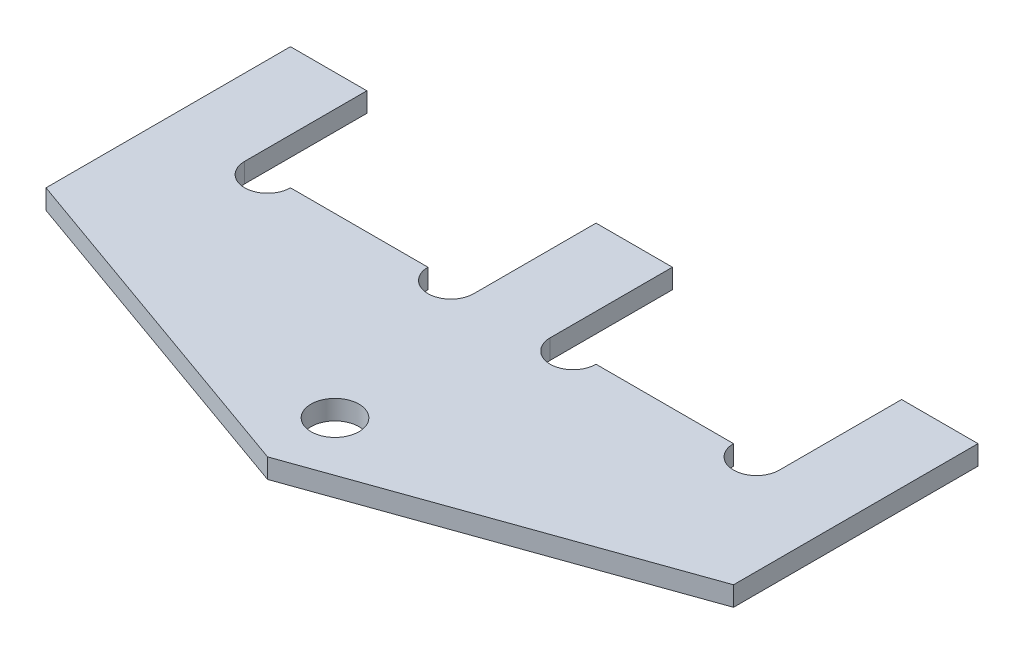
ISO-10303-21;
HEADER;
FILE_DESCRIPTION(('STEP AP214'),'2;1');
FILE_NAME('part.step','',(''),(''),'','','');
FILE_SCHEMA(('AUTOMOTIVE_DESIGN { 1 0 10303 214 1 1 1 1 }'));
ENDSEC;
DATA;
#1=APPLICATION_CONTEXT('core data for automotive mechanical design processes');
#2=APPLICATION_PROTOCOL_DEFINITION('international standard','automotive_design',2000,#1);
#3=PRODUCT_CONTEXT('',#1,'mechanical');
#4=PRODUCT('Part','Part','',(#3));
#5=PRODUCT_RELATED_PRODUCT_CATEGORY('part','',(#4));
#6=PRODUCT_DEFINITION_FORMATION('','',#4);
#7=PRODUCT_DEFINITION_CONTEXT('part definition',#1,'design');
#8=PRODUCT_DEFINITION('design','',#6,#7);
#9=PRODUCT_DEFINITION_SHAPE('','',#8);
#10=(LENGTH_UNIT() NAMED_UNIT(*) SI_UNIT(.MILLI.,.METRE.));
#11=(NAMED_UNIT(*) PLANE_ANGLE_UNIT() SI_UNIT($,.RADIAN.));
#12=(NAMED_UNIT(*) SI_UNIT($,.STERADIAN.) SOLID_ANGLE_UNIT());
#13=UNCERTAINTY_MEASURE_WITH_UNIT(LENGTH_MEASURE(1.E-05),#10,'distance_accuracy_value','');
#14=(GEOMETRIC_REPRESENTATION_CONTEXT(3) GLOBAL_UNCERTAINTY_ASSIGNED_CONTEXT((#13)) GLOBAL_UNIT_ASSIGNED_CONTEXT((#10,
#11,#12)) REPRESENTATION_CONTEXT('',''));
#15=CARTESIAN_POINT('',(0.,0.,0.));
#16=DIRECTION('',(0.,0.,1.));
#17=DIRECTION('',(1.,0.,0.));
#18=AXIS2_PLACEMENT_3D('',#15,#16,#17);
#19=CARTESIAN_POINT('',(0.,-2.032,7.0104));
#20=DIRECTION('',(-0.335009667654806,0.,0.942214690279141));
#21=DIRECTION('',(0.942214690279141,0.,0.335009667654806));
#22=AXIS2_PLACEMENT_3D('',#19,#20,#21);
#23=PLANE('',#22);
#24=DIRECTION('',(0.942214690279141,0.,0.335009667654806));
#25=VECTOR('',#24,1.);
#26=CARTESIAN_POINT('',(0.,0.,7.0104));
#27=LINE('',#26,#25);
#28=CARTESIAN_POINT('',(-35.71875,0.,-5.6896));
#29=VERTEX_POINT('',#28);
#30=CARTESIAN_POINT('',(0.,0.,7.0104));
#31=VERTEX_POINT('',#30);
#32=EDGE_CURVE('E188',#29,#31,#27,.T.);
#33=ORIENTED_EDGE('',*,*,#32,.F.);
#34=DIRECTION('',(0.,1.,0.));
#35=VECTOR('',#34,1.);
#36=CARTESIAN_POINT('',(-35.71875,-2.032,-5.6896));
#37=LINE('',#36,#35);
#38=CARTESIAN_POINT('',(-35.71875,-2.032,-5.6896));
#39=VERTEX_POINT('',#38);
#40=EDGE_CURVE('E11',#39,#29,#37,.T.);
#41=ORIENTED_EDGE('',*,*,#40,.F.);
#42=DIRECTION('',(0.942214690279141,0.,0.335009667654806));
#43=VECTOR('',#42,1.);
#44=CARTESIAN_POINT('',(0.,-2.032,7.0104));
#45=LINE('',#44,#43);
#46=CARTESIAN_POINT('',(0.,-2.032,7.0104));
#47=VERTEX_POINT('',#46);
#48=EDGE_CURVE('E236',#39,#47,#45,.T.);
#49=ORIENTED_EDGE('',*,*,#48,.T.);
#50=DIRECTION('',(0.,1.,0.));
#51=VECTOR('',#50,1.);
#52=CARTESIAN_POINT('',(0.,-2.032,7.0104));
#53=LINE('',#52,#51);
#54=EDGE_CURVE('E40',#47,#31,#53,.T.);
#55=ORIENTED_EDGE('',*,*,#54,.T.);
#56=EDGE_LOOP('',(#33,#41,#49,#55));
#57=FACE_BOUND('',#56,.T.);
#58=ADVANCED_FACE('F37',(#57),#23,.T.);
#59=CARTESIAN_POINT('',(-35.71875,-2.032,-5.6896));
#60=DIRECTION('',(-1.,0.,0.));
#61=DIRECTION('',(0.,0.,1.));
#62=AXIS2_PLACEMENT_3D('',#59,#60,#61);
#63=PLANE('',#62);
#64=DIRECTION('',(0.,0.,1.));
#65=VECTOR('',#64,1.);
#66=CARTESIAN_POINT('',(-35.71875,0.,-5.6896));
#67=LINE('',#66,#65);
#68=CARTESIAN_POINT('',(-35.71875,0.,-31.0896));
#69=VERTEX_POINT('',#68);
#70=EDGE_CURVE('E234',#69,#29,#67,.T.);
#71=ORIENTED_EDGE('',*,*,#70,.F.);
#72=DIRECTION('',(0.,1.,0.));
#73=VECTOR('',#72,1.);
#74=CARTESIAN_POINT('',(-35.71875,-2.032,-31.0896));
#75=LINE('',#74,#73);
#76=CARTESIAN_POINT('',(-35.71875,-2.032,-31.0896));
#77=VERTEX_POINT('',#76);
#78=EDGE_CURVE('E46',#77,#69,#75,.T.);
#79=ORIENTED_EDGE('',*,*,#78,.F.);
#80=DIRECTION('',(0.,0.,1.));
#81=VECTOR('',#80,1.);
#82=CARTESIAN_POINT('',(-35.71875,-2.032,-5.6896));
#83=LINE('',#82,#81);
#84=EDGE_CURVE('E178',#77,#39,#83,.T.);
#85=ORIENTED_EDGE('',*,*,#84,.T.);
#86=ORIENTED_EDGE('',*,*,#40,.T.);
#87=EDGE_LOOP('',(#71,#79,#85,#86));
#88=FACE_BOUND('',#87,.T.);
#89=ADVANCED_FACE('F266',(#88),#63,.T.);
#90=CARTESIAN_POINT('',(-35.71875,-2.032,-31.0896));
#91=DIRECTION('',(0.,0.,-1.));
#92=DIRECTION('',(-1.,0.,0.));
#93=AXIS2_PLACEMENT_3D('',#90,#91,#92);
#94=PLANE('',#93);
#95=DIRECTION('',(-1.,0.,0.));
#96=VECTOR('',#95,1.);
#97=CARTESIAN_POINT('',(-35.71875,0.,-31.0896));
#98=LINE('',#97,#96);
#99=CARTESIAN_POINT('',(-27.78125,0.,-31.0896));
#100=VERTEX_POINT('',#99);
#101=EDGE_CURVE('E165',#100,#69,#98,.T.);
#102=ORIENTED_EDGE('',*,*,#101,.F.);
#103=DIRECTION('',(0.,1.,0.));
#104=VECTOR('',#103,1.);
#105=CARTESIAN_POINT('',(-27.78125,-2.032,-31.0896));
#106=LINE('',#105,#104);
#107=CARTESIAN_POINT('',(-27.78125,-2.032,-31.0896));
#108=VERTEX_POINT('',#107);
#109=EDGE_CURVE('E160',#108,#100,#106,.T.);
#110=ORIENTED_EDGE('',*,*,#109,.F.);
#111=DIRECTION('',(-1.,0.,0.));
#112=VECTOR('',#111,1.);
#113=CARTESIAN_POINT('',(-35.71875,-2.032,-31.0896));
#114=LINE('',#113,#112);
#115=EDGE_CURVE('E163',#108,#77,#114,.T.);
#116=ORIENTED_EDGE('',*,*,#115,.T.);
#117=ORIENTED_EDGE('',*,*,#78,.T.);
#118=EDGE_LOOP('',(#102,#110,#116,#117));
#119=FACE_BOUND('',#118,.T.);
#120=ADVANCED_FACE('F162',(#119),#94,.T.);
#121=CARTESIAN_POINT('',(-27.78125,-2.032,-31.0896));
#122=DIRECTION('',(1.,0.,0.));
#123=DIRECTION('',(0.,0.,-1.));
#124=AXIS2_PLACEMENT_3D('',#121,#122,#123);
#125=PLANE('',#124);
#126=DIRECTION('',(0.,0.,-1.));
#127=VECTOR('',#126,1.);
#128=CARTESIAN_POINT('',(-27.78125,0.,-31.0896));
#129=LINE('',#128,#127);
#130=CARTESIAN_POINT('',(-27.78125,0.,-18.3896));
#131=VERTEX_POINT('',#130);
#132=EDGE_CURVE('E231',#131,#100,#129,.T.);
#133=ORIENTED_EDGE('',*,*,#132,.F.);
#134=DIRECTION('',(0.,1.,0.));
#135=VECTOR('',#134,1.);
#136=CARTESIAN_POINT('',(-27.78125,-2.032,-18.3896));
#137=LINE('',#136,#135);
#138=CARTESIAN_POINT('',(-27.78125,-2.032,-18.3896));
#139=VERTEX_POINT('',#138);
#140=EDGE_CURVE('E170',#139,#131,#137,.T.);
#141=ORIENTED_EDGE('',*,*,#140,.F.);
#142=DIRECTION('',(0.,0.,-1.));
#143=VECTOR('',#142,1.);
#144=CARTESIAN_POINT('',(-27.78125,-2.032,-31.0896));
#145=LINE('',#144,#143);
#146=EDGE_CURVE('E176',#139,#108,#145,.T.);
#147=ORIENTED_EDGE('',*,*,#146,.T.);
#148=ORIENTED_EDGE('',*,*,#109,.T.);
#149=EDGE_LOOP('',(#133,#141,#147,#148));
#150=FACE_BOUND('',#149,.T.);
#151=ADVANCED_FACE('F180',(#150),#125,.T.);
#152=CARTESIAN_POINT('',(-25.4,-2.032,-18.3896));
#153=DIRECTION('',(0.,1.,0.));
#154=DIRECTION('',(0.,0.,1.));
#155=AXIS2_PLACEMENT_3D('',#152,#153,#154);
#156=CYLINDRICAL_SURFACE('',#155,2.38125);
#157=CARTESIAN_POINT('',(-25.4,0.,-18.3896));
#158=DIRECTION('',(0.,-1.,0.));
#159=DIRECTION('',(0.,0.,1.));
#160=AXIS2_PLACEMENT_3D('',#157,#158,#159);
#161=CIRCLE('',#160,2.38125);
#162=CARTESIAN_POINT('',(-23.01875,0.,-18.3896));
#163=VERTEX_POINT('',#162);
#164=EDGE_CURVE('E228',#163,#131,#161,.T.);
#165=ORIENTED_EDGE('',*,*,#164,.F.);
#166=DIRECTION('',(0.,1.,0.));
#167=VECTOR('',#166,1.);
#168=CARTESIAN_POINT('',(-23.01875,-2.032,-18.3896));
#169=LINE('',#168,#167);
#170=CARTESIAN_POINT('',(-23.01875,-2.032,-18.3896));
#171=VERTEX_POINT('',#170);
#172=EDGE_CURVE('E240',#171,#163,#169,.T.);
#173=ORIENTED_EDGE('',*,*,#172,.F.);
#174=CARTESIAN_POINT('',(-25.4,-2.032,-18.3896));
#175=DIRECTION('',(0.,-1.,0.));
#176=DIRECTION('',(0.,0.,1.));
#177=AXIS2_PLACEMENT_3D('',#174,#175,#176);
#178=CIRCLE('',#177,2.38125);
#179=EDGE_CURVE('E181',#171,#139,#178,.T.);
#180=ORIENTED_EDGE('',*,*,#179,.T.);
#181=ORIENTED_EDGE('',*,*,#140,.T.);
#182=EDGE_LOOP('',(#165,#173,#180,#181));
#183=FACE_BOUND('',#182,.T.);
#184=ADVANCED_FACE('F279',(#183),#156,.F.);
#185=CARTESIAN_POINT('',(-23.01875,-2.032,-18.3896));
#186=DIRECTION('',(0.,0.,-1.));
#187=DIRECTION('',(-1.,0.,0.));
#188=AXIS2_PLACEMENT_3D('',#185,#186,#187);
#189=PLANE('',#188);
#190=DIRECTION('',(-1.,0.,0.));
#191=VECTOR('',#190,1.);
#192=CARTESIAN_POINT('',(-23.01875,0.,-18.3896));
#193=LINE('',#192,#191);
#194=CARTESIAN_POINT('',(-8.73125,0.,-18.3896));
#195=VERTEX_POINT('',#194);
#196=EDGE_CURVE('E225',#195,#163,#193,.T.);
#197=ORIENTED_EDGE('',*,*,#196,.F.);
#198=DIRECTION('',(0.,1.,0.));
#199=VECTOR('',#198,1.);
#200=CARTESIAN_POINT('',(-8.73125,-2.032,-18.3896));
#201=LINE('',#200,#199);
#202=CARTESIAN_POINT('',(-8.73125,-2.032,-18.3896));
#203=VERTEX_POINT('',#202);
#204=EDGE_CURVE('E242',#203,#195,#201,.T.);
#205=ORIENTED_EDGE('',*,*,#204,.F.);
#206=DIRECTION('',(-1.,0.,0.));
#207=VECTOR('',#206,1.);
#208=CARTESIAN_POINT('',(-23.01875,-2.032,-18.3896));
#209=LINE('',#208,#207);
#210=EDGE_CURVE('E183',#203,#171,#209,.T.);
#211=ORIENTED_EDGE('',*,*,#210,.T.);
#212=ORIENTED_EDGE('',*,*,#172,.T.);
#213=EDGE_LOOP('',(#197,#205,#211,#212));
#214=FACE_BOUND('',#213,.T.);
#215=ADVANCED_FACE('F282',(#214),#189,.T.);
#216=CARTESIAN_POINT('',(-6.35,-2.032,-18.3896));
#217=DIRECTION('',(0.,1.,0.));
#218=DIRECTION('',(0.,0.,1.));
#219=AXIS2_PLACEMENT_3D('',#216,#217,#218);
#220=CYLINDRICAL_SURFACE('',#219,2.38125);
#221=CARTESIAN_POINT('',(-6.35,0.,-18.3896));
#222=DIRECTION('',(0.,-1.,0.));
#223=DIRECTION('',(0.,0.,-1.));
#224=AXIS2_PLACEMENT_3D('',#221,#222,#223);
#225=CIRCLE('',#224,2.38125);
#226=CARTESIAN_POINT('',(-3.96875,0.,-18.3896));
#227=VERTEX_POINT('',#226);
#228=EDGE_CURVE('E222',#227,#195,#225,.T.);
#229=ORIENTED_EDGE('',*,*,#228,.F.);
#230=DIRECTION('',(0.,1.,0.));
#231=VECTOR('',#230,1.);
#232=CARTESIAN_POINT('',(-3.96875,-2.032,-18.3896));
#233=LINE('',#232,#231);
#234=CARTESIAN_POINT('',(-3.96875,-2.032,-18.3896));
#235=VERTEX_POINT('',#234);
#236=EDGE_CURVE('E244',#235,#227,#233,.T.);
#237=ORIENTED_EDGE('',*,*,#236,.F.);
#238=CARTESIAN_POINT('',(-6.35,-2.032,-18.3896));
#239=DIRECTION('',(0.,-1.,0.));
#240=DIRECTION('',(0.,0.,-1.));
#241=AXIS2_PLACEMENT_3D('',#238,#239,#240);
#242=CIRCLE('',#241,2.38125);
#243=EDGE_CURVE('E380',#235,#203,#242,.T.);
#244=ORIENTED_EDGE('',*,*,#243,.T.);
#245=ORIENTED_EDGE('',*,*,#204,.T.);
#246=EDGE_LOOP('',(#229,#237,#244,#245));
#247=FACE_BOUND('',#246,.T.);
#248=ADVANCED_FACE('F286',(#247),#220,.F.);
#249=CARTESIAN_POINT('',(-3.96875,-2.032,-31.0896));
#250=DIRECTION('',(-1.,0.,0.));
#251=DIRECTION('',(0.,0.,1.));
#252=AXIS2_PLACEMENT_3D('',#249,#250,#251);
#253=PLANE('',#252);
#254=DIRECTION('',(0.,0.,1.));
#255=VECTOR('',#254,1.);
#256=CARTESIAN_POINT('',(-3.96875,0.,-31.0896));
#257=LINE('',#256,#255);
#258=CARTESIAN_POINT('',(-3.96875,0.,-31.0896));
#259=VERTEX_POINT('',#258);
#260=EDGE_CURVE('E219',#259,#227,#257,.T.);
#261=ORIENTED_EDGE('',*,*,#260,.F.);
#262=DIRECTION('',(0.,1.,0.));
#263=VECTOR('',#262,1.);
#264=CARTESIAN_POINT('',(-3.96875,-2.032,-31.0896));
#265=LINE('',#264,#263);
#266=CARTESIAN_POINT('',(-3.96875,-2.032,-31.0896));
#267=VERTEX_POINT('',#266);
#268=EDGE_CURVE('E246',#267,#259,#265,.T.);
#269=ORIENTED_EDGE('',*,*,#268,.F.);
#270=DIRECTION('',(0.,0.,1.));
#271=VECTOR('',#270,1.);
#272=CARTESIAN_POINT('',(-3.96875,-2.032,-31.0896));
#273=LINE('',#272,#271);
#274=EDGE_CURVE('E377',#267,#235,#273,.T.);
#275=ORIENTED_EDGE('',*,*,#274,.T.);
#276=ORIENTED_EDGE('',*,*,#236,.T.);
#277=EDGE_LOOP('',(#261,#269,#275,#276));
#278=FACE_BOUND('',#277,.T.);
#279=ADVANCED_FACE('F290',(#278),#253,.T.);
#280=CARTESIAN_POINT('',(-3.96875,-2.032,-31.0896));
#281=DIRECTION('',(0.,0.,-1.));
#282=DIRECTION('',(-1.,0.,0.));
#283=AXIS2_PLACEMENT_3D('',#280,#281,#282);
#284=PLANE('',#283);
#285=DIRECTION('',(-1.,0.,0.));
#286=VECTOR('',#285,1.);
#287=CARTESIAN_POINT('',(-3.96875,0.,-31.0896));
#288=LINE('',#287,#286);
#289=CARTESIAN_POINT('',(3.96875,0.,-31.0896));
#290=VERTEX_POINT('',#289);
#291=EDGE_CURVE('E216',#290,#259,#288,.T.);
#292=ORIENTED_EDGE('',*,*,#291,.F.);
#293=DIRECTION('',(0.,1.,0.));
#294=VECTOR('',#293,1.);
#295=CARTESIAN_POINT('',(3.96875,-2.032,-31.0896));
#296=LINE('',#295,#294);
#297=CARTESIAN_POINT('',(3.96875,-2.032,-31.0896));
#298=VERTEX_POINT('',#297);
#299=EDGE_CURVE('E248',#298,#290,#296,.T.);
#300=ORIENTED_EDGE('',*,*,#299,.F.);
#301=DIRECTION('',(-1.,0.,0.));
#302=VECTOR('',#301,1.);
#303=CARTESIAN_POINT('',(-3.96875,-2.032,-31.0896));
#304=LINE('',#303,#302);
#305=EDGE_CURVE('E374',#298,#267,#304,.T.);
#306=ORIENTED_EDGE('',*,*,#305,.T.);
#307=ORIENTED_EDGE('',*,*,#268,.T.);
#308=EDGE_LOOP('',(#292,#300,#306,#307));
#309=FACE_BOUND('',#308,.T.);
#310=ADVANCED_FACE('F294',(#309),#284,.T.);
#311=CARTESIAN_POINT('',(3.96875,-2.032,-31.0896));
#312=DIRECTION('',(1.,0.,0.));
#313=DIRECTION('',(0.,0.,-1.));
#314=AXIS2_PLACEMENT_3D('',#311,#312,#313);
#315=PLANE('',#314);
#316=DIRECTION('',(0.,0.,-1.));
#317=VECTOR('',#316,1.);
#318=CARTESIAN_POINT('',(3.96875,0.,-31.0896));
#319=LINE('',#318,#317);
#320=CARTESIAN_POINT('',(3.96875,0.,-18.3896));
#321=VERTEX_POINT('',#320);
#322=EDGE_CURVE('E213',#321,#290,#319,.T.);
#323=ORIENTED_EDGE('',*,*,#322,.F.);
#324=DIRECTION('',(0.,1.,0.));
#325=VECTOR('',#324,1.);
#326=CARTESIAN_POINT('',(3.96875,-2.032,-18.3896));
#327=LINE('',#326,#325);
#328=CARTESIAN_POINT('',(3.96875,-2.032,-18.3896));
#329=VERTEX_POINT('',#328);
#330=EDGE_CURVE('E250',#329,#321,#327,.T.);
#331=ORIENTED_EDGE('',*,*,#330,.F.);
#332=DIRECTION('',(0.,0.,-1.));
#333=VECTOR('',#332,1.);
#334=CARTESIAN_POINT('',(3.96875,-2.032,-31.0896));
#335=LINE('',#334,#333);
#336=EDGE_CURVE('E371',#329,#298,#335,.T.);
#337=ORIENTED_EDGE('',*,*,#336,.T.);
#338=ORIENTED_EDGE('',*,*,#299,.T.);
#339=EDGE_LOOP('',(#323,#331,#337,#338));
#340=FACE_BOUND('',#339,.T.);
#341=ADVANCED_FACE('F298',(#340),#315,.T.);
#342=CARTESIAN_POINT('',(6.35,-2.032,-18.3896));
#343=DIRECTION('',(0.,1.,0.));
#344=DIRECTION('',(0.,0.,1.));
#345=AXIS2_PLACEMENT_3D('',#342,#343,#344);
#346=CYLINDRICAL_SURFACE('',#345,2.38125);
#347=CARTESIAN_POINT('',(6.35,0.,-18.3896));
#348=DIRECTION('',(0.,-1.,0.));
#349=DIRECTION('',(0.,0.,1.));
#350=AXIS2_PLACEMENT_3D('',#347,#348,#349);
#351=CIRCLE('',#350,2.38125);
#352=CARTESIAN_POINT('',(8.73125,0.,-18.3896));
#353=VERTEX_POINT('',#352);
#354=EDGE_CURVE('E210',#353,#321,#351,.T.);
#355=ORIENTED_EDGE('',*,*,#354,.F.);
#356=DIRECTION('',(0.,1.,0.));
#357=VECTOR('',#356,1.);
#358=CARTESIAN_POINT('',(8.73125,-2.032,-18.3896));
#359=LINE('',#358,#357);
#360=CARTESIAN_POINT('',(8.73125,-2.032,-18.3896));
#361=VERTEX_POINT('',#360);
#362=EDGE_CURVE('E252',#361,#353,#359,.T.);
#363=ORIENTED_EDGE('',*,*,#362,.F.);
#364=CARTESIAN_POINT('',(6.35,-2.032,-18.3896));
#365=DIRECTION('',(0.,-1.,0.));
#366=DIRECTION('',(0.,0.,1.));
#367=AXIS2_PLACEMENT_3D('',#364,#365,#366);
#368=CIRCLE('',#367,2.38125);
#369=EDGE_CURVE('E368',#361,#329,#368,.T.);
#370=ORIENTED_EDGE('',*,*,#369,.T.);
#371=ORIENTED_EDGE('',*,*,#330,.T.);
#372=EDGE_LOOP('',(#355,#363,#370,#371));
#373=FACE_BOUND('',#372,.T.);
#374=ADVANCED_FACE('F302',(#373),#346,.F.);
#375=CARTESIAN_POINT('',(23.01875,-2.032,-18.3896));
#376=DIRECTION('',(0.,0.,-1.));
#377=DIRECTION('',(-1.,0.,0.));
#378=AXIS2_PLACEMENT_3D('',#375,#376,#377);
#379=PLANE('',#378);
#380=DIRECTION('',(-1.,0.,0.));
#381=VECTOR('',#380,1.);
#382=CARTESIAN_POINT('',(23.01875,0.,-18.3896));
#383=LINE('',#382,#381);
#384=CARTESIAN_POINT('',(23.01875,0.,-18.3896));
#385=VERTEX_POINT('',#384);
#386=EDGE_CURVE('E207',#385,#353,#383,.T.);
#387=ORIENTED_EDGE('',*,*,#386,.F.);
#388=DIRECTION('',(0.,1.,0.));
#389=VECTOR('',#388,1.);
#390=CARTESIAN_POINT('',(23.01875,-2.032,-18.3896));
#391=LINE('',#390,#389);
#392=CARTESIAN_POINT('',(23.01875,-2.032,-18.3896));
#393=VERTEX_POINT('',#392);
#394=EDGE_CURVE('E254',#393,#385,#391,.T.);
#395=ORIENTED_EDGE('',*,*,#394,.F.);
#396=DIRECTION('',(-1.,0.,0.));
#397=VECTOR('',#396,1.);
#398=CARTESIAN_POINT('',(23.01875,-2.032,-18.3896));
#399=LINE('',#398,#397);
#400=EDGE_CURVE('E365',#393,#361,#399,.T.);
#401=ORIENTED_EDGE('',*,*,#400,.T.);
#402=ORIENTED_EDGE('',*,*,#362,.T.);
#403=EDGE_LOOP('',(#387,#395,#401,#402));
#404=FACE_BOUND('',#403,.T.);
#405=ADVANCED_FACE('F306',(#404),#379,.T.);
#406=CARTESIAN_POINT('',(25.4,-2.032,-18.3896));
#407=DIRECTION('',(0.,1.,0.));
#408=DIRECTION('',(0.,0.,1.));
#409=AXIS2_PLACEMENT_3D('',#406,#407,#408);
#410=CYLINDRICAL_SURFACE('',#409,2.38125);
#411=CARTESIAN_POINT('',(25.4,0.,-18.3896));
#412=DIRECTION('',(0.,-1.,0.));
#413=DIRECTION('',(0.,0.,-1.));
#414=AXIS2_PLACEMENT_3D('',#411,#412,#413);
#415=CIRCLE('',#414,2.38125);
#416=CARTESIAN_POINT('',(27.78125,0.,-18.3896));
#417=VERTEX_POINT('',#416);
#418=EDGE_CURVE('E204',#417,#385,#415,.T.);
#419=ORIENTED_EDGE('',*,*,#418,.F.);
#420=DIRECTION('',(0.,1.,0.));
#421=VECTOR('',#420,1.);
#422=CARTESIAN_POINT('',(27.78125,-2.032,-18.3896));
#423=LINE('',#422,#421);
#424=CARTESIAN_POINT('',(27.78125,-2.032,-18.3896));
#425=VERTEX_POINT('',#424);
#426=EDGE_CURVE('E256',#425,#417,#423,.T.);
#427=ORIENTED_EDGE('',*,*,#426,.F.);
#428=CARTESIAN_POINT('',(25.4,-2.032,-18.3896));
#429=DIRECTION('',(0.,-1.,0.));
#430=DIRECTION('',(0.,0.,-1.));
#431=AXIS2_PLACEMENT_3D('',#428,#429,#430);
#432=CIRCLE('',#431,2.38125);
#433=EDGE_CURVE('E362',#425,#393,#432,.T.);
#434=ORIENTED_EDGE('',*,*,#433,.T.);
#435=ORIENTED_EDGE('',*,*,#394,.T.);
#436=EDGE_LOOP('',(#419,#427,#434,#435));
#437=FACE_BOUND('',#436,.T.);
#438=ADVANCED_FACE('F310',(#437),#410,.F.);
#439=CARTESIAN_POINT('',(27.78125,-2.032,-31.0896));
#440=DIRECTION('',(-1.,0.,0.));
#441=DIRECTION('',(0.,0.,1.));
#442=AXIS2_PLACEMENT_3D('',#439,#440,#441);
#443=PLANE('',#442);
#444=DIRECTION('',(0.,0.,1.));
#445=VECTOR('',#444,1.);
#446=CARTESIAN_POINT('',(27.78125,0.,-31.0896));
#447=LINE('',#446,#445);
#448=CARTESIAN_POINT('',(27.78125,0.,-31.0896));
#449=VERTEX_POINT('',#448);
#450=EDGE_CURVE('E201',#449,#417,#447,.T.);
#451=ORIENTED_EDGE('',*,*,#450,.F.);
#452=DIRECTION('',(0.,1.,0.));
#453=VECTOR('',#452,1.);
#454=CARTESIAN_POINT('',(27.78125,-2.032,-31.0896));
#455=LINE('',#454,#453);
#456=CARTESIAN_POINT('',(27.78125,-2.032,-31.0896));
#457=VERTEX_POINT('',#456);
#458=EDGE_CURVE('E258',#457,#449,#455,.T.);
#459=ORIENTED_EDGE('',*,*,#458,.F.);
#460=DIRECTION('',(0.,0.,1.));
#461=VECTOR('',#460,1.);
#462=CARTESIAN_POINT('',(27.78125,-2.032,-31.0896));
#463=LINE('',#462,#461);
#464=EDGE_CURVE('E359',#457,#425,#463,.T.);
#465=ORIENTED_EDGE('',*,*,#464,.T.);
#466=ORIENTED_EDGE('',*,*,#426,.T.);
#467=EDGE_LOOP('',(#451,#459,#465,#466));
#468=FACE_BOUND('',#467,.T.);
#469=ADVANCED_FACE('F314',(#468),#443,.T.);
#470=CARTESIAN_POINT('',(35.71875,-2.032,-31.0896));
#471=DIRECTION('',(0.,0.,-1.));
#472=DIRECTION('',(-1.,0.,0.));
#473=AXIS2_PLACEMENT_3D('',#470,#471,#472);
#474=PLANE('',#473);
#475=DIRECTION('',(-1.,0.,0.));
#476=VECTOR('',#475,1.);
#477=CARTESIAN_POINT('',(35.71875,0.,-31.0896));
#478=LINE('',#477,#476);
#479=CARTESIAN_POINT('',(35.71875,0.,-31.0896));
#480=VERTEX_POINT('',#479);
#481=EDGE_CURVE('E198',#480,#449,#478,.T.);
#482=ORIENTED_EDGE('',*,*,#481,.F.);
#483=DIRECTION('',(0.,1.,0.));
#484=VECTOR('',#483,1.);
#485=CARTESIAN_POINT('',(35.71875,-2.032,-31.0896));
#486=LINE('',#485,#484);
#487=CARTESIAN_POINT('',(35.71875,-2.032,-31.0896));
#488=VERTEX_POINT('',#487);
#489=EDGE_CURVE('E260',#488,#480,#486,.T.);
#490=ORIENTED_EDGE('',*,*,#489,.F.);
#491=DIRECTION('',(-1.,0.,0.));
#492=VECTOR('',#491,1.);
#493=CARTESIAN_POINT('',(35.71875,-2.032,-31.0896));
#494=LINE('',#493,#492);
#495=EDGE_CURVE('E356',#488,#457,#494,.T.);
#496=ORIENTED_EDGE('',*,*,#495,.T.);
#497=ORIENTED_EDGE('',*,*,#458,.T.);
#498=EDGE_LOOP('',(#482,#490,#496,#497));
#499=FACE_BOUND('',#498,.T.);
#500=ADVANCED_FACE('F318',(#499),#474,.T.);
#501=CARTESIAN_POINT('',(35.71875,-2.032,-5.6896));
#502=DIRECTION('',(1.,0.,0.));
#503=DIRECTION('',(0.,0.,-1.));
#504=AXIS2_PLACEMENT_3D('',#501,#502,#503);
#505=PLANE('',#504);
#506=DIRECTION('',(0.,0.,-1.));
#507=VECTOR('',#506,1.);
#508=CARTESIAN_POINT('',(35.71875,0.,-5.6896));
#509=LINE('',#508,#507);
#510=CARTESIAN_POINT('',(35.71875,0.,-5.6896));
#511=VERTEX_POINT('',#510);
#512=EDGE_CURVE('E195',#511,#480,#509,.T.);
#513=ORIENTED_EDGE('',*,*,#512,.F.);
#514=DIRECTION('',(0.,1.,0.));
#515=VECTOR('',#514,1.);
#516=CARTESIAN_POINT('',(35.71875,-2.032,-5.6896));
#517=LINE('',#516,#515);
#518=CARTESIAN_POINT('',(35.71875,-2.032,-5.6896));
#519=VERTEX_POINT('',#518);
#520=EDGE_CURVE('E261',#519,#511,#517,.T.);
#521=ORIENTED_EDGE('',*,*,#520,.F.);
#522=DIRECTION('',(0.,0.,-1.));
#523=VECTOR('',#522,1.);
#524=CARTESIAN_POINT('',(35.71875,-2.032,-5.6896));
#525=LINE('',#524,#523);
#526=EDGE_CURVE('E353',#519,#488,#525,.T.);
#527=ORIENTED_EDGE('',*,*,#526,.T.);
#528=ORIENTED_EDGE('',*,*,#489,.T.);
#529=EDGE_LOOP('',(#513,#521,#527,#528));
#530=FACE_BOUND('',#529,.T.);
#531=ADVANCED_FACE('F322',(#530),#505,.T.);
#532=CARTESIAN_POINT('',(0.,-2.032,7.0104));
#533=DIRECTION('',(0.335009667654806,0.,0.942214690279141));
#534=DIRECTION('',(0.942214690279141,0.,-0.335009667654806));
#535=AXIS2_PLACEMENT_3D('',#532,#533,#534);
#536=PLANE('',#535);
#537=DIRECTION('',(0.942214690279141,0.,-0.335009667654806));
#538=VECTOR('',#537,1.);
#539=CARTESIAN_POINT('',(0.,0.,7.0104));
#540=LINE('',#539,#538);
#541=EDGE_CURVE('E191',#31,#511,#540,.T.);
#542=ORIENTED_EDGE('',*,*,#541,.F.);
#543=ORIENTED_EDGE('',*,*,#54,.F.);
#544=DIRECTION('',(0.942214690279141,0.,-0.335009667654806));
#545=VECTOR('',#544,1.);
#546=CARTESIAN_POINT('',(0.,-2.032,7.0104));
#547=LINE('',#546,#545);
#548=EDGE_CURVE('E351',#47,#519,#547,.T.);
#549=ORIENTED_EDGE('',*,*,#548,.T.);
#550=ORIENTED_EDGE('',*,*,#520,.T.);
#551=EDGE_LOOP('',(#542,#543,#549,#550));
#552=FACE_BOUND('',#551,.T.);
#553=ADVANCED_FACE('F263',(#552),#536,.T.);
#554=CARTESIAN_POINT('',(-25.4,-2.032,-18.3896));
#555=DIRECTION('',(0.,1.,0.));
#556=DIRECTION('',(0.,0.,1.));
#557=AXIS2_PLACEMENT_3D('',#554,#555,#556);
#558=PLANE('',#557);
#559=CARTESIAN_POINT('',(0.,-2.032,0.));
#560=DIRECTION('',(0.,1.,0.));
#561=DIRECTION('',(0.,0.,1.));
#562=AXIS2_PLACEMENT_3D('',#559,#560,#561);
#563=CIRCLE('',#562,2.4892);
#564=CARTESIAN_POINT('',(0.,-2.032,2.4892));
#565=VERTEX_POINT('',#564);
#566=EDGE_CURVE('E192',#565,#565,#563,.T.);
#567=ORIENTED_EDGE('',*,*,#566,.T.);
#568=EDGE_LOOP('',(#567));
#569=FACE_BOUND('',#568,.T.);
#570=ORIENTED_EDGE('',*,*,#48,.F.);
#571=ORIENTED_EDGE('',*,*,#84,.F.);
#572=ORIENTED_EDGE('',*,*,#115,.F.);
#573=ORIENTED_EDGE('',*,*,#146,.F.);
#574=ORIENTED_EDGE('',*,*,#179,.F.);
#575=ORIENTED_EDGE('',*,*,#210,.F.);
#576=ORIENTED_EDGE('',*,*,#243,.F.);
#577=ORIENTED_EDGE('',*,*,#274,.F.);
#578=ORIENTED_EDGE('',*,*,#305,.F.);
#579=ORIENTED_EDGE('',*,*,#336,.F.);
#580=ORIENTED_EDGE('',*,*,#369,.F.);
#581=ORIENTED_EDGE('',*,*,#400,.F.);
#582=ORIENTED_EDGE('',*,*,#433,.F.);
#583=ORIENTED_EDGE('',*,*,#464,.F.);
#584=ORIENTED_EDGE('',*,*,#495,.F.);
#585=ORIENTED_EDGE('',*,*,#526,.F.);
#586=ORIENTED_EDGE('',*,*,#548,.F.);
#587=EDGE_LOOP('',(#570,#571,#572,#573,#574,#575,#576,#577,#578,#579,#580,#581,#582,#583,#584,
#585,#586));
#588=FACE_BOUND('',#587,.T.);
#589=ADVANCED_FACE('F174',(#569,#588),#558,.F.);
#590=CARTESIAN_POINT('',(-25.4,0.,-18.3896));
#591=DIRECTION('',(0.,1.,0.));
#592=DIRECTION('',(0.,0.,1.));
#593=AXIS2_PLACEMENT_3D('',#590,#591,#592);
#594=PLANE('',#593);
#595=CARTESIAN_POINT('',(0.,0.,0.));
#596=DIRECTION('',(0.,1.,0.));
#597=DIRECTION('',(0.,0.,1.));
#598=AXIS2_PLACEMENT_3D('',#595,#596,#597);
#599=CIRCLE('',#598,2.4892);
#600=CARTESIAN_POINT('',(0.,0.,2.4892));
#601=VERTEX_POINT('',#600);
#602=EDGE_CURVE('E346',#601,#601,#599,.T.);
#603=ORIENTED_EDGE('',*,*,#602,.F.);
#604=EDGE_LOOP('',(#603));
#605=FACE_BOUND('',#604,.T.);
#606=ORIENTED_EDGE('',*,*,#32,.T.);
#607=ORIENTED_EDGE('',*,*,#541,.T.);
#608=ORIENTED_EDGE('',*,*,#512,.T.);
#609=ORIENTED_EDGE('',*,*,#481,.T.);
#610=ORIENTED_EDGE('',*,*,#450,.T.);
#611=ORIENTED_EDGE('',*,*,#418,.T.);
#612=ORIENTED_EDGE('',*,*,#386,.T.);
#613=ORIENTED_EDGE('',*,*,#354,.T.);
#614=ORIENTED_EDGE('',*,*,#322,.T.);
#615=ORIENTED_EDGE('',*,*,#291,.T.);
#616=ORIENTED_EDGE('',*,*,#260,.T.);
#617=ORIENTED_EDGE('',*,*,#228,.T.);
#618=ORIENTED_EDGE('',*,*,#196,.T.);
#619=ORIENTED_EDGE('',*,*,#164,.T.);
#620=ORIENTED_EDGE('',*,*,#132,.T.);
#621=ORIENTED_EDGE('',*,*,#101,.T.);
#622=ORIENTED_EDGE('',*,*,#70,.T.);
#623=EDGE_LOOP('',(#606,#607,#608,#609,#610,#611,#612,#613,#614,#615,#616,#617,#618,#619,#620,
#621,#622));
#624=FACE_BOUND('',#623,.T.);
#625=ADVANCED_FACE('F265',(#605,#624),#594,.T.);
#626=CARTESIAN_POINT('',(0.,-2.032,0.));
#627=DIRECTION('',(0.,1.,0.));
#628=DIRECTION('',(0.,0.,1.));
#629=AXIS2_PLACEMENT_3D('',#626,#627,#628);
#630=CYLINDRICAL_SURFACE('',#629,2.4892);
#631=ORIENTED_EDGE('',*,*,#566,.F.);
#632=EDGE_LOOP('',(#631));
#633=FACE_BOUND('',#632,.T.);
#634=ORIENTED_EDGE('',*,*,#602,.T.);
#635=EDGE_LOOP('',(#634));
#636=FACE_BOUND('',#635,.T.);
#637=ADVANCED_FACE('F334',(#633,#636),#630,.F.);
#638=CLOSED_SHELL('',(#58,#89,#120,#151,#184,#215,#248,#279,#310,#341,#374,#405,#438,#469,#500,
#531,#553,#589,#625,#637));
#639=MANIFOLD_SOLID_BREP('B2',#638);
#640=ADVANCED_BREP_SHAPE_REPRESENTATION('',(#18,#639),#14);
#641=SHAPE_DEFINITION_REPRESENTATION(#9,#640);
ENDSEC;
END-ISO-10303-21;
